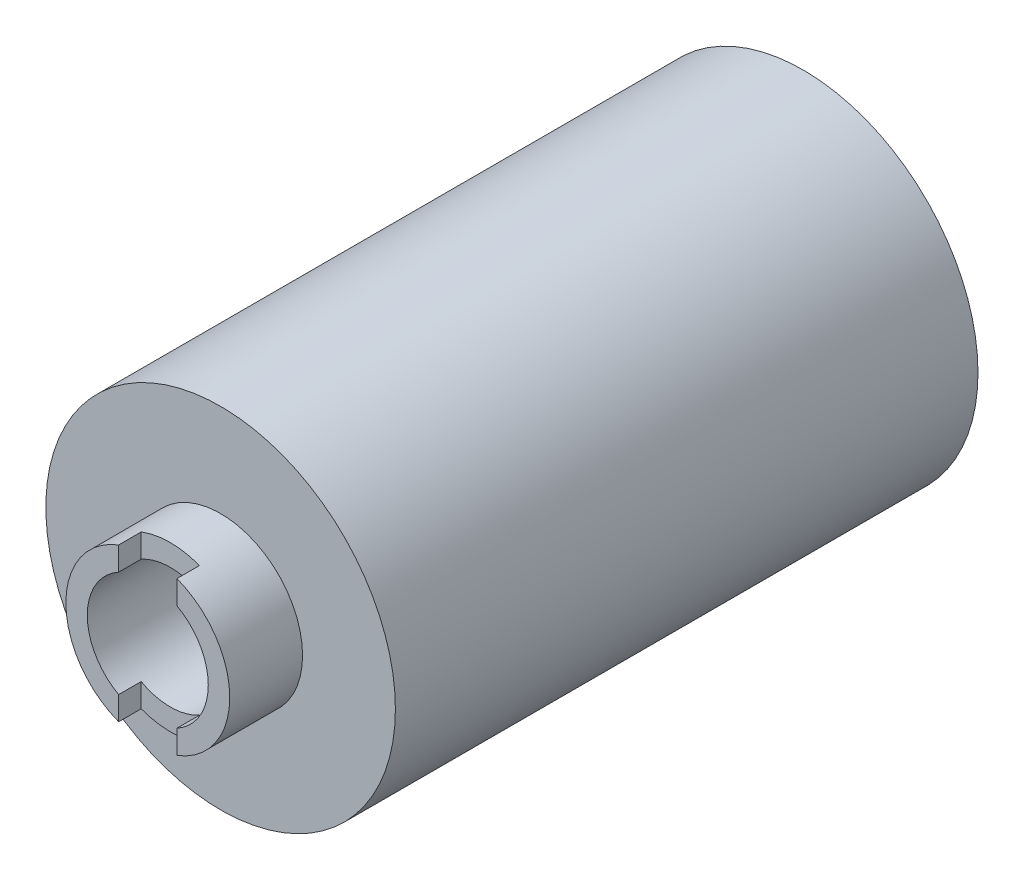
ISO-10303-21;
HEADER;
FILE_DESCRIPTION(('STEP AP214'),'2;1');
FILE_NAME('part.step','',(''),(''),'','','');
FILE_SCHEMA(('AUTOMOTIVE_DESIGN { 1 0 10303 214 1 1 1 1 }'));
ENDSEC;
DATA;
#1=APPLICATION_CONTEXT('core data for automotive mechanical design processes');
#2=APPLICATION_PROTOCOL_DEFINITION('international standard','automotive_design',2000,#1);
#3=PRODUCT_CONTEXT('',#1,'mechanical');
#4=PRODUCT('Part','Part','',(#3));
#5=PRODUCT_RELATED_PRODUCT_CATEGORY('part','',(#4));
#6=PRODUCT_DEFINITION_FORMATION('','',#4);
#7=PRODUCT_DEFINITION_CONTEXT('part definition',#1,'design');
#8=PRODUCT_DEFINITION('design','',#6,#7);
#9=PRODUCT_DEFINITION_SHAPE('','',#8);
#10=(LENGTH_UNIT() NAMED_UNIT(*) SI_UNIT(.MILLI.,.METRE.));
#11=(NAMED_UNIT(*) PLANE_ANGLE_UNIT() SI_UNIT($,.RADIAN.));
#12=(NAMED_UNIT(*) SI_UNIT($,.STERADIAN.) SOLID_ANGLE_UNIT());
#13=UNCERTAINTY_MEASURE_WITH_UNIT(LENGTH_MEASURE(1.E-05),#10,'distance_accuracy_value','');
#14=(GEOMETRIC_REPRESENTATION_CONTEXT(3) GLOBAL_UNCERTAINTY_ASSIGNED_CONTEXT((#13)) GLOBAL_UNIT_ASSIGNED_CONTEXT((#10,
#11,#12)) REPRESENTATION_CONTEXT('',''));
#15=CARTESIAN_POINT('',(0.,0.,0.));
#16=DIRECTION('',(0.,0.,1.));
#17=DIRECTION('',(1.,0.,0.));
#18=AXIS2_PLACEMENT_3D('',#15,#16,#17);
#19=CARTESIAN_POINT('',(0.,0.,225.));
#20=DIRECTION('',(0.,0.,1.));
#21=DIRECTION('',(1.,0.,0.));
#22=AXIS2_PLACEMENT_3D('',#19,#20,#21);
#23=PLANE('',#22);
#24=DIRECTION('',(0.,1.,0.));
#25=VECTOR('',#24,1.);
#26=CARTESIAN_POINT('',(10.,0.,225.));
#27=LINE('',#26,#25);
#28=CARTESIAN_POINT('',(10.,-26.2917890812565,225.));
#29=VERTEX_POINT('',#28);
#30=CARTESIAN_POINT('',(10.,-18.196885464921,225.));
#31=VERTEX_POINT('',#30);
#32=EDGE_CURVE('E108',#29,#31,#27,.T.);
#33=ORIENTED_EDGE('',*,*,#32,.F.);
#34=CARTESIAN_POINT('',(0.,0.,225.));
#35=DIRECTION('',(0.,0.,1.));
#36=DIRECTION('',(1.,0.,0.));
#37=AXIS2_PLACEMENT_3D('',#34,#35,#36);
#38=CIRCLE('',#37,28.1293116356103);
#39=CARTESIAN_POINT('',(10.,26.2917890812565,225.));
#40=VERTEX_POINT('',#39);
#41=EDGE_CURVE('E141',#29,#40,#38,.T.);
#42=ORIENTED_EDGE('',*,*,#41,.T.);
#43=CARTESIAN_POINT('',(10.,18.196885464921,225.));
#44=VERTEX_POINT('',#43);
#45=EDGE_CURVE('E132',#44,#40,#27,.T.);
#46=ORIENTED_EDGE('',*,*,#45,.F.);
#47=CARTESIAN_POINT('',(0.,0.,225.));
#48=DIRECTION('',(0.,0.,1.));
#49=DIRECTION('',(1.,0.,0.));
#50=AXIS2_PLACEMENT_3D('',#47,#48,#49);
#51=CIRCLE('',#50,20.7635893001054);
#52=EDGE_CURVE('E137',#31,#44,#51,.T.);
#53=ORIENTED_EDGE('',*,*,#52,.F.);
#54=EDGE_LOOP('',(#33,#42,#46,#53));
#55=FACE_BOUND('',#54,.T.);
#56=ADVANCED_FACE('F32',(#55),#23,.T.);
#57=CARTESIAN_POINT('',(0.,0.,200.));
#58=DIRECTION('',(0.,0.,-1.));
#59=DIRECTION('',(-1.,0.,0.));
#60=AXIS2_PLACEMENT_3D('',#57,#58,#59);
#61=CYLINDRICAL_SURFACE('',#60,60.);
#62=CARTESIAN_POINT('',(0.,0.,200.));
#63=DIRECTION('',(0.,0.,1.));
#64=DIRECTION('',(1.,0.,0.));
#65=AXIS2_PLACEMENT_3D('',#62,#63,#64);
#66=CIRCLE('',#65,60.);
#67=CARTESIAN_POINT('',(60.,0.,200.));
#68=VERTEX_POINT('',#67);
#69=EDGE_CURVE('E152',#68,#68,#66,.T.);
#70=ORIENTED_EDGE('',*,*,#69,.F.);
#71=EDGE_LOOP('',(#70));
#72=FACE_BOUND('',#71,.T.);
#73=CARTESIAN_POINT('',(0.,0.,0.));
#74=DIRECTION('',(0.,0.,1.));
#75=DIRECTION('',(1.,0.,0.));
#76=AXIS2_PLACEMENT_3D('',#73,#74,#75);
#77=CIRCLE('',#76,60.);
#78=CARTESIAN_POINT('',(60.,0.,0.));
#79=VERTEX_POINT('',#78);
#80=EDGE_CURVE('E155',#79,#79,#77,.T.);
#81=ORIENTED_EDGE('',*,*,#80,.T.);
#82=EDGE_LOOP('',(#81));
#83=FACE_BOUND('',#82,.T.);
#84=ADVANCED_FACE('F34',(#72,#83),#61,.T.);
#85=CARTESIAN_POINT('',(0.,0.,200.));
#86=DIRECTION('',(0.,0.,1.));
#87=DIRECTION('',(1.,0.,0.));
#88=AXIS2_PLACEMENT_3D('',#85,#86,#87);
#89=PLANE('',#88);
#90=CARTESIAN_POINT('',(0.,0.,200.));
#91=DIRECTION('',(0.,0.,1.));
#92=DIRECTION('',(1.,0.,0.));
#93=AXIS2_PLACEMENT_3D('',#90,#91,#92);
#94=CIRCLE('',#93,28.1293116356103);
#95=CARTESIAN_POINT('',(28.1293116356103,0.,200.));
#96=VERTEX_POINT('',#95);
#97=EDGE_CURVE('E148',#96,#96,#94,.T.);
#98=ORIENTED_EDGE('',*,*,#97,.F.);
#99=EDGE_LOOP('',(#98));
#100=FACE_BOUND('',#99,.T.);
#101=ORIENTED_EDGE('',*,*,#69,.T.);
#102=EDGE_LOOP('',(#101));
#103=FACE_BOUND('',#102,.T.);
#104=ADVANCED_FACE('F198',(#100,#103),#89,.T.);
#105=CARTESIAN_POINT('',(0.,0.,0.));
#106=DIRECTION('',(0.,0.,1.));
#107=DIRECTION('',(1.,0.,0.));
#108=AXIS2_PLACEMENT_3D('',#105,#106,#107);
#109=PLANE('',#108);
#110=CARTESIAN_POINT('',(0.,0.,0.));
#111=DIRECTION('',(0.,0.,1.));
#112=DIRECTION('',(1.,0.,0.));
#113=AXIS2_PLACEMENT_3D('',#110,#111,#112);
#114=CIRCLE('',#113,20.7635893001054);
#115=CARTESIAN_POINT('',(20.7635893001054,0.,0.));
#116=VERTEX_POINT('',#115);
#117=EDGE_CURVE('E138',#116,#116,#114,.T.);
#118=ORIENTED_EDGE('',*,*,#117,.T.);
#119=EDGE_LOOP('',(#118));
#120=FACE_BOUND('',#119,.T.);
#121=ORIENTED_EDGE('',*,*,#80,.F.);
#122=EDGE_LOOP('',(#121));
#123=FACE_BOUND('',#122,.T.);
#124=ADVANCED_FACE('F192',(#120,#123),#109,.F.);
#125=CARTESIAN_POINT('',(0.,0.,225.));
#126=DIRECTION('',(0.,0.,-1.));
#127=DIRECTION('',(-1.,0.,0.));
#128=AXIS2_PLACEMENT_3D('',#125,#126,#127);
#129=CYLINDRICAL_SURFACE('',#128,28.1293116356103);
#130=CARTESIAN_POINT('',(0.,0.,217.263208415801));
#131=DIRECTION('',(0.,0.,-1.));
#132=DIRECTION('',(-1.,0.,0.));
#133=AXIS2_PLACEMENT_3D('',#130,#131,#132);
#134=CIRCLE('',#133,28.1293116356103);
#135=CARTESIAN_POINT('',(-9.99999999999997,26.2917890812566,217.263208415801));
#136=VERTEX_POINT('',#135);
#137=CARTESIAN_POINT('',(10.,26.2917890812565,217.263208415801));
#138=VERTEX_POINT('',#137);
#139=EDGE_CURVE('E121',#136,#138,#134,.T.);
#140=ORIENTED_EDGE('',*,*,#139,.T.);
#141=DIRECTION('',(0.,0.,-1.));
#142=VECTOR('',#141,1.);
#143=CARTESIAN_POINT('',(10.,26.2917890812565,225.));
#144=LINE('',#143,#142);
#145=EDGE_CURVE('E134',#138,#40,#144,.F.);
#146=ORIENTED_EDGE('',*,*,#145,.T.);
#147=ORIENTED_EDGE('',*,*,#41,.F.);
#148=DIRECTION('',(0.,0.,-1.));
#149=VECTOR('',#148,1.);
#150=CARTESIAN_POINT('',(10.,-26.2917890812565,225.));
#151=LINE('',#150,#149);
#152=CARTESIAN_POINT('',(10.,-26.2917890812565,217.263208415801));
#153=VERTEX_POINT('',#152);
#154=EDGE_CURVE('E120',#29,#153,#151,.T.);
#155=ORIENTED_EDGE('',*,*,#154,.T.);
#156=CARTESIAN_POINT('',(-9.99999999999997,-26.2917890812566,217.263208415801));
#157=VERTEX_POINT('',#156);
#158=EDGE_CURVE('E111',#153,#157,#134,.T.);
#159=ORIENTED_EDGE('',*,*,#158,.T.);
#160=DIRECTION('',(0.,0.,-1.));
#161=VECTOR('',#160,1.);
#162=CARTESIAN_POINT('',(-9.99999999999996,-26.2917890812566,225.));
#163=LINE('',#162,#161);
#164=CARTESIAN_POINT('',(-9.99999999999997,-26.2917890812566,225.));
#165=VERTEX_POINT('',#164);
#166=EDGE_CURVE('E97',#157,#165,#163,.F.);
#167=ORIENTED_EDGE('',*,*,#166,.T.);
#168=CARTESIAN_POINT('',(-9.99999999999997,26.2917890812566,225.));
#169=VERTEX_POINT('',#168);
#170=EDGE_CURVE('E147',#169,#165,#38,.T.);
#171=ORIENTED_EDGE('',*,*,#170,.F.);
#172=DIRECTION('',(0.,0.,-1.));
#173=VECTOR('',#172,1.);
#174=CARTESIAN_POINT('',(-9.99999999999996,26.2917890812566,225.));
#175=LINE('',#174,#173);
#176=EDGE_CURVE('E128',#169,#136,#175,.T.);
#177=ORIENTED_EDGE('',*,*,#176,.T.);
#178=EDGE_LOOP('',(#140,#146,#147,#155,#159,#167,#171,#177));
#179=FACE_BOUND('',#178,.T.);
#180=ORIENTED_EDGE('',*,*,#97,.T.);
#181=EDGE_LOOP('',(#180));
#182=FACE_BOUND('',#181,.T.);
#183=ADVANCED_FACE('F117',(#179,#182),#129,.T.);
#184=DIRECTION('',(0.,-1.,0.));
#185=VECTOR('',#184,1.);
#186=CARTESIAN_POINT('',(-9.99999999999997,0.,225.));
#187=LINE('',#186,#185);
#188=CARTESIAN_POINT('',(-9.99999999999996,18.196885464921,225.));
#189=VERTEX_POINT('',#188);
#190=EDGE_CURVE('E123',#169,#189,#187,.T.);
#191=ORIENTED_EDGE('',*,*,#190,.F.);
#192=ORIENTED_EDGE('',*,*,#170,.T.);
#193=CARTESIAN_POINT('',(-9.99999999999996,-18.196885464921,225.));
#194=VERTEX_POINT('',#193);
#195=EDGE_CURVE('E103',#194,#165,#187,.T.);
#196=ORIENTED_EDGE('',*,*,#195,.F.);
#197=EDGE_CURVE('E142',#189,#194,#51,.T.);
#198=ORIENTED_EDGE('',*,*,#197,.F.);
#199=EDGE_LOOP('',(#191,#192,#196,#198));
#200=FACE_BOUND('',#199,.T.);
#201=ADVANCED_FACE('F184',(#200),#23,.T.);
#202=CARTESIAN_POINT('',(0.,0.,0.));
#203=DIRECTION('',(0.,0.,1.));
#204=DIRECTION('',(1.,0.,0.));
#205=AXIS2_PLACEMENT_3D('',#202,#203,#204);
#206=CYLINDRICAL_SURFACE('',#205,20.7635893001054);
#207=CARTESIAN_POINT('',(0.,0.,217.263208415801));
#208=DIRECTION('',(0.,0.,-1.));
#209=DIRECTION('',(-1.,0.,0.));
#210=AXIS2_PLACEMENT_3D('',#207,#208,#209);
#211=CIRCLE('',#210,20.7635893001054);
#212=CARTESIAN_POINT('',(-9.99999999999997,-18.196885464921,217.263208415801));
#213=VERTEX_POINT('',#212);
#214=CARTESIAN_POINT('',(10.,-18.196885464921,217.263208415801));
#215=VERTEX_POINT('',#214);
#216=EDGE_CURVE('E113',#213,#215,#211,.F.);
#217=ORIENTED_EDGE('',*,*,#216,.T.);
#218=DIRECTION('',(0.,0.,1.));
#219=VECTOR('',#218,1.);
#220=CARTESIAN_POINT('',(10.,-18.196885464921,0.));
#221=LINE('',#220,#219);
#222=EDGE_CURVE('E11',#215,#31,#221,.T.);
#223=ORIENTED_EDGE('',*,*,#222,.T.);
#224=ORIENTED_EDGE('',*,*,#52,.T.);
#225=DIRECTION('',(0.,0.,1.));
#226=VECTOR('',#225,1.);
#227=CARTESIAN_POINT('',(10.,18.196885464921,0.));
#228=LINE('',#227,#226);
#229=CARTESIAN_POINT('',(10.,18.196885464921,217.263208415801));
#230=VERTEX_POINT('',#229);
#231=EDGE_CURVE('E163',#44,#230,#228,.F.);
#232=ORIENTED_EDGE('',*,*,#231,.T.);
#233=CARTESIAN_POINT('',(-9.99999999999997,18.196885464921,217.263208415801));
#234=VERTEX_POINT('',#233);
#235=EDGE_CURVE('E151',#230,#234,#211,.F.);
#236=ORIENTED_EDGE('',*,*,#235,.T.);
#237=DIRECTION('',(0.,0.,1.));
#238=VECTOR('',#237,1.);
#239=CARTESIAN_POINT('',(-9.99999999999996,18.196885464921,0.));
#240=LINE('',#239,#238);
#241=EDGE_CURVE('E160',#234,#189,#240,.T.);
#242=ORIENTED_EDGE('',*,*,#241,.T.);
#243=ORIENTED_EDGE('',*,*,#197,.T.);
#244=DIRECTION('',(0.,0.,1.));
#245=VECTOR('',#244,1.);
#246=CARTESIAN_POINT('',(-9.99999999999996,-18.196885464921,0.));
#247=LINE('',#246,#245);
#248=EDGE_CURVE('E40',#194,#213,#247,.F.);
#249=ORIENTED_EDGE('',*,*,#248,.T.);
#250=EDGE_LOOP('',(#217,#223,#224,#232,#236,#242,#243,#249));
#251=FACE_BOUND('',#250,.T.);
#252=ORIENTED_EDGE('',*,*,#117,.F.);
#253=EDGE_LOOP('',(#252));
#254=FACE_BOUND('',#253,.T.);
#255=ADVANCED_FACE('F167',(#251,#254),#206,.F.);
#256=CARTESIAN_POINT('',(10.,-60.,217.263208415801));
#257=DIRECTION('',(0.,0.,-1.));
#258=DIRECTION('',(-1.,0.,0.));
#259=AXIS2_PLACEMENT_3D('',#256,#257,#258);
#260=PLANE('',#259);
#261=DIRECTION('',(0.,1.,0.));
#262=VECTOR('',#261,1.);
#263=CARTESIAN_POINT('',(-9.99999999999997,-60.,217.263208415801));
#264=LINE('',#263,#262);
#265=EDGE_CURVE('E55',#234,#136,#264,.T.);
#266=ORIENTED_EDGE('',*,*,#265,.F.);
#267=ORIENTED_EDGE('',*,*,#235,.F.);
#268=DIRECTION('',(0.,1.,0.));
#269=VECTOR('',#268,1.);
#270=CARTESIAN_POINT('',(10.,-60.,217.263208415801));
#271=LINE('',#270,#269);
#272=EDGE_CURVE('E126',#230,#138,#271,.T.);
#273=ORIENTED_EDGE('',*,*,#272,.T.);
#274=ORIENTED_EDGE('',*,*,#139,.F.);
#275=EDGE_LOOP('',(#266,#267,#273,#274));
#276=FACE_BOUND('',#275,.T.);
#277=ADVANCED_FACE('F178',(#276),#260,.F.);
#278=CARTESIAN_POINT('',(-9.99999999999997,-60.,240.478419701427));
#279=DIRECTION('',(-1.,0.,0.));
#280=DIRECTION('',(0.,0.,1.));
#281=AXIS2_PLACEMENT_3D('',#278,#279,#280);
#282=PLANE('',#281);
#283=ORIENTED_EDGE('',*,*,#190,.T.);
#284=ORIENTED_EDGE('',*,*,#241,.F.);
#285=ORIENTED_EDGE('',*,*,#265,.T.);
#286=ORIENTED_EDGE('',*,*,#176,.F.);
#287=EDGE_LOOP('',(#283,#284,#285,#286));
#288=FACE_BOUND('',#287,.T.);
#289=ADVANCED_FACE('F180',(#288),#282,.F.);
#290=CARTESIAN_POINT('',(10.,-60.,240.478419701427));
#291=DIRECTION('',(1.,0.,0.));
#292=DIRECTION('',(0.,0.,-1.));
#293=AXIS2_PLACEMENT_3D('',#290,#291,#292);
#294=PLANE('',#293);
#295=ORIENTED_EDGE('',*,*,#272,.F.);
#296=ORIENTED_EDGE('',*,*,#231,.F.);
#297=ORIENTED_EDGE('',*,*,#45,.T.);
#298=ORIENTED_EDGE('',*,*,#145,.F.);
#299=EDGE_LOOP('',(#295,#296,#297,#298));
#300=FACE_BOUND('',#299,.T.);
#301=ADVANCED_FACE('F176',(#300),#294,.F.);
#302=ORIENTED_EDGE('',*,*,#32,.T.);
#303=ORIENTED_EDGE('',*,*,#222,.F.);
#304=EDGE_CURVE('E47',#153,#215,#271,.T.);
#305=ORIENTED_EDGE('',*,*,#304,.F.);
#306=ORIENTED_EDGE('',*,*,#154,.F.);
#307=EDGE_LOOP('',(#302,#303,#305,#306));
#308=FACE_BOUND('',#307,.T.);
#309=ADVANCED_FACE('F257',(#308),#294,.F.);
#310=EDGE_CURVE('E100',#157,#213,#264,.T.);
#311=ORIENTED_EDGE('',*,*,#310,.T.);
#312=ORIENTED_EDGE('',*,*,#248,.F.);
#313=ORIENTED_EDGE('',*,*,#195,.T.);
#314=ORIENTED_EDGE('',*,*,#166,.F.);
#315=EDGE_LOOP('',(#311,#312,#313,#314));
#316=FACE_BOUND('',#315,.T.);
#317=ADVANCED_FACE('F99',(#316),#282,.F.);
#318=ORIENTED_EDGE('',*,*,#304,.T.);
#319=ORIENTED_EDGE('',*,*,#216,.F.);
#320=ORIENTED_EDGE('',*,*,#310,.F.);
#321=ORIENTED_EDGE('',*,*,#158,.F.);
#322=EDGE_LOOP('',(#318,#319,#320,#321));
#323=FACE_BOUND('',#322,.T.);
#324=ADVANCED_FACE('F110',(#323),#260,.F.);
#325=CLOSED_SHELL('',(#56,#84,#104,#124,#183,#201,#255,#277,#289,#301,#309,#317,#324));
#326=MANIFOLD_SOLID_BREP('B2',#325);
#327=ADVANCED_BREP_SHAPE_REPRESENTATION('',(#18,#326),#14);
#328=SHAPE_DEFINITION_REPRESENTATION(#9,#327);
ENDSEC;
END-ISO-10303-21;
